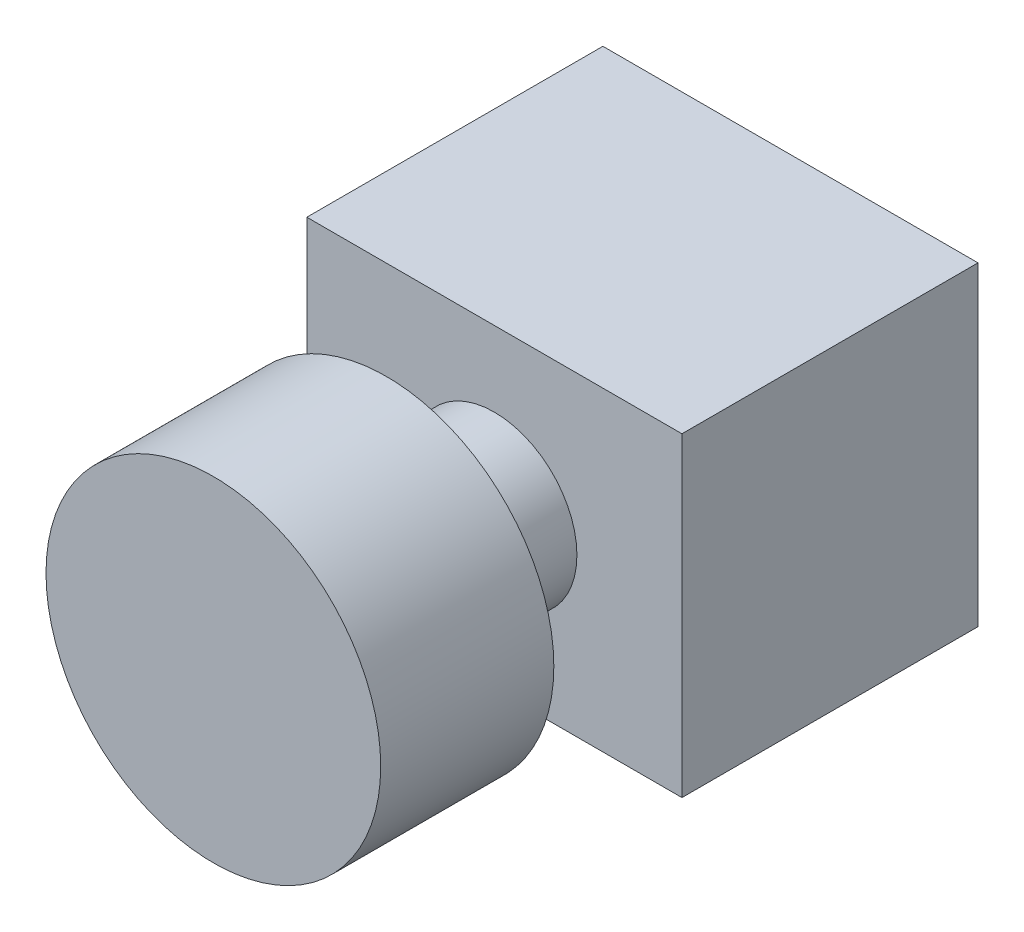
from build123d import *

# Parameters (mm, degrees)
SKETCH1_W           = 16.51
SKETCH1_H           = 13.8684
BOSS_EXTRUDE1_DEPTH = 13.0302
SKETCH2_R           = 3.6322
BOSS_EXTRUDE2_DEPTH = 12.3698
SKETCH3_R           = 7.366
BOSS_EXTRUDE3_DEPTH = 7.62


with BuildPart() as part:
    # Sketch1 → Boss-Extrude1 (new body)
    with BuildSketch(Plane.XY):
        Rectangle(SKETCH1_W, SKETCH1_H)
    extrude(amount=BOSS_EXTRUDE1_DEPTH)

    # Sketch2 → Boss-Extrude2 (add)
    with BuildSketch(Plane.XY.offset(13.0302)):
        Circle(SKETCH2_R)
    extrude(amount=BOSS_EXTRUDE2_DEPTH)

    # Sketch3 → Boss-Extrude3 (add)
    with BuildSketch(Plane.XY.offset(25.4)):
        Circle(SKETCH3_R)
    extrude(amount=-BOSS_EXTRUDE3_DEPTH)


solid = part.part
